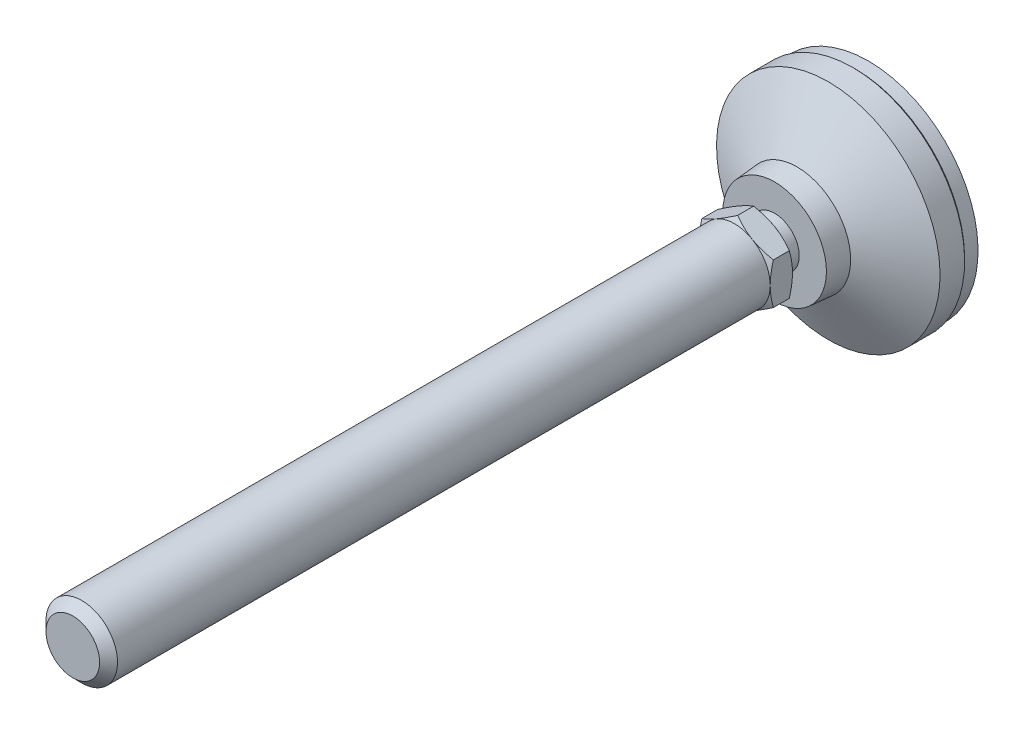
ISO-10303-21;
HEADER;
FILE_DESCRIPTION(('STEP AP214'),'2;1');
FILE_NAME('part.step','',(''),(''),'','','');
FILE_SCHEMA(('AUTOMOTIVE_DESIGN { 1 0 10303 214 1 1 1 1 }'));
ENDSEC;
DATA;
#1=APPLICATION_CONTEXT('core data for automotive mechanical design processes');
#2=APPLICATION_PROTOCOL_DEFINITION('international standard','automotive_design',2000,#1);
#3=PRODUCT_CONTEXT('',#1,'mechanical');
#4=PRODUCT('Part','Part','',(#3));
#5=PRODUCT_RELATED_PRODUCT_CATEGORY('part','',(#4));
#6=PRODUCT_DEFINITION_FORMATION('','',#4);
#7=PRODUCT_DEFINITION_CONTEXT('part definition',#1,'design');
#8=PRODUCT_DEFINITION('design','',#6,#7);
#9=PRODUCT_DEFINITION_SHAPE('','',#8);
#10=(LENGTH_UNIT() NAMED_UNIT(*) SI_UNIT(.MILLI.,.METRE.));
#11=(NAMED_UNIT(*) PLANE_ANGLE_UNIT() SI_UNIT($,.RADIAN.));
#12=(NAMED_UNIT(*) SI_UNIT($,.STERADIAN.) SOLID_ANGLE_UNIT());
#13=UNCERTAINTY_MEASURE_WITH_UNIT(LENGTH_MEASURE(1.E-05),#10,'distance_accuracy_value','');
#14=(GEOMETRIC_REPRESENTATION_CONTEXT(3) GLOBAL_UNCERTAINTY_ASSIGNED_CONTEXT((#13)) GLOBAL_UNIT_ASSIGNED_CONTEXT((#10,
#11,#12)) REPRESENTATION_CONTEXT('',''));
#15=CARTESIAN_POINT('',(0.,0.,0.));
#16=DIRECTION('',(0.,0.,1.));
#17=DIRECTION('',(1.,0.,0.));
#18=AXIS2_PLACEMENT_3D('',#15,#16,#17);
#19=CARTESIAN_POINT('',(0.,-5.50000000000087,24.9999999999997));
#20=DIRECTION('',(0.,0.,-1.));
#21=DIRECTION('',(0.,1.,0.));
#22=AXIS2_PLACEMENT_3D('',#19,#20,#21);
#23=PLANE('',#22);
#24=CARTESIAN_POINT('',(0.,0.,24.9999999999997));
#25=DIRECTION('',(0.,0.,-1.));
#26=DIRECTION('',(0.,1.,0.));
#27=AXIS2_PLACEMENT_3D('',#24,#25,#26);
#28=CIRCLE('',#27,8.0000000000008);
#29=CARTESIAN_POINT('',(-4.00000000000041,6.92820323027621,24.9999999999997));
#30=VERTEX_POINT('',#29);
#31=CARTESIAN_POINT('',(-8.00000000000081,0.,24.9999999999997));
#32=VERTEX_POINT('',#31);
#33=EDGE_CURVE('E9',#30,#32,#28,.F.);
#34=ORIENTED_EDGE('',*,*,#33,.F.);
#35=CARTESIAN_POINT('',(4.,6.92820323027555,24.9999999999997));
#36=VERTEX_POINT('',#35);
#37=EDGE_CURVE('E18',#36,#30,#28,.F.);
#38=ORIENTED_EDGE('',*,*,#37,.F.);
#39=CARTESIAN_POINT('',(8.00000000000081,0.,24.9999999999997));
#40=VERTEX_POINT('',#39);
#41=EDGE_CURVE('E125',#40,#36,#28,.F.);
#42=ORIENTED_EDGE('',*,*,#41,.F.);
#43=CARTESIAN_POINT('',(0.,0.,24.9999999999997));
#44=DIRECTION('',(0.,0.,1.));
#45=DIRECTION('',(0.,-1.,0.));
#46=AXIS2_PLACEMENT_3D('',#43,#44,#45);
#47=CIRCLE('',#46,8.00000000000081);
#48=CARTESIAN_POINT('',(4.00000000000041,-6.92820323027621,24.9999999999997));
#49=VERTEX_POINT('',#48);
#50=EDGE_CURVE('E608',#49,#40,#47,.T.);
#51=ORIENTED_EDGE('',*,*,#50,.F.);
#52=CARTESIAN_POINT('',(-4.00000000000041,-6.92820323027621,24.9999999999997));
#53=VERTEX_POINT('',#52);
#54=EDGE_CURVE('E610',#53,#49,#28,.F.);
#55=ORIENTED_EDGE('',*,*,#54,.F.);
#56=EDGE_CURVE('E23',#32,#53,#28,.F.);
#57=ORIENTED_EDGE('',*,*,#56,.F.);
#58=EDGE_LOOP('',(#34,#38,#42,#51,#55,#57));
#59=FACE_BOUND('',#58,.T.);
#60=CARTESIAN_POINT('',(0.,0.,24.9999999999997));
#61=DIRECTION('',(0.,0.,-1.));
#62=DIRECTION('',(0.,1.,0.));
#63=AXIS2_PLACEMENT_3D('',#60,#61,#62);
#64=CIRCLE('',#63,5.50000000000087);
#65=CARTESIAN_POINT('',(0.,5.50000000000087,24.9999999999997));
#66=VERTEX_POINT('',#65);
#67=EDGE_CURVE('E235',#66,#66,#64,.T.);
#68=ORIENTED_EDGE('',*,*,#67,.F.);
#69=EDGE_LOOP('',(#68));
#70=FACE_BOUND('',#69,.T.);
#71=ADVANCED_FACE('F14',(#59,#70),#23,.T.);
#72=CARTESIAN_POINT('',(0.,0.,2.));
#73=DIRECTION('',(0.,0.,-1.));
#74=DIRECTION('',(0.,1.,0.));
#75=AXIS2_PLACEMENT_3D('',#72,#73,#74);
#76=CYLINDRICAL_SURFACE('',#75,5.50000000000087);
#77=CARTESIAN_POINT('',(0.,0.,21.));
#78=DIRECTION('',(0.,0.,-1.));
#79=DIRECTION('',(0.,1.,0.));
#80=AXIS2_PLACEMENT_3D('',#77,#78,#79);
#81=CIRCLE('',#80,5.50000000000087);
#82=CARTESIAN_POINT('',(0.,5.50000000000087,21.));
#83=VERTEX_POINT('',#82);
#84=EDGE_CURVE('E238',#83,#83,#81,.T.);
#85=ORIENTED_EDGE('',*,*,#84,.F.);
#86=EDGE_LOOP('',(#85));
#87=FACE_BOUND('',#86,.T.);
#88=ORIENTED_EDGE('',*,*,#67,.T.);
#89=EDGE_LOOP('',(#88));
#90=FACE_BOUND('',#89,.T.);
#91=ADVANCED_FACE('F297',(#87,#90),#76,.T.);
#92=CARTESIAN_POINT('',(0.,-5.50000000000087,21.));
#93=DIRECTION('',(0.,0.,1.));
#94=DIRECTION('',(0.,-1.,0.));
#95=AXIS2_PLACEMENT_3D('',#92,#93,#94);
#96=PLANE('',#95);
#97=ORIENTED_EDGE('',*,*,#84,.T.);
#98=EDGE_LOOP('',(#97));
#99=FACE_BOUND('',#98,.T.);
#100=CARTESIAN_POINT('',(0.,0.,21.));
#101=DIRECTION('',(0.,0.,1.));
#102=DIRECTION('',(0.,-1.,0.));
#103=AXIS2_PLACEMENT_3D('',#100,#101,#102);
#104=CIRCLE('',#103,11.5833333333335);
#105=CARTESIAN_POINT('',(0.,-11.5833333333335,21.));
#106=VERTEX_POINT('',#105);
#107=EDGE_CURVE('E241',#106,#106,#104,.T.);
#108=ORIENTED_EDGE('',*,*,#107,.T.);
#109=EDGE_LOOP('',(#108));
#110=FACE_BOUND('',#109,.T.);
#111=ADVANCED_FACE('F199',(#99,#110),#96,.T.);
#112=CARTESIAN_POINT('',(0.,0.,2.));
#113=DIRECTION('',(0.,0.,-1.));
#114=DIRECTION('',(0.,1.,0.));
#115=AXIS2_PLACEMENT_3D('',#112,#113,#114);
#116=CYLINDRICAL_SURFACE('',#115,25.);
#117=CARTESIAN_POINT('',(0.,0.,3.5));
#118=DIRECTION('',(0.,0.,-1.));
#119=DIRECTION('',(0.,1.,0.));
#120=AXIS2_PLACEMENT_3D('',#117,#118,#119);
#121=CIRCLE('',#120,25.);
#122=CARTESIAN_POINT('',(0.,25.,3.5));
#123=VERTEX_POINT('',#122);
#124=EDGE_CURVE('E126',#123,#123,#121,.F.);
#125=ORIENTED_EDGE('',*,*,#124,.T.);
#126=EDGE_LOOP('',(#125));
#127=FACE_BOUND('',#126,.T.);
#128=CARTESIAN_POINT('',(0.,0.,8.9999999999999));
#129=DIRECTION('',(0.,0.,-1.));
#130=DIRECTION('',(0.,1.,0.));
#131=AXIS2_PLACEMENT_3D('',#128,#129,#130);
#132=CIRCLE('',#131,25.);
#133=CARTESIAN_POINT('',(0.,25.,8.9999999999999));
#134=VERTEX_POINT('',#133);
#135=EDGE_CURVE('E244',#134,#134,#132,.T.);
#136=ORIENTED_EDGE('',*,*,#135,.T.);
#137=EDGE_LOOP('',(#136));
#138=FACE_BOUND('',#137,.T.);
#139=ADVANCED_FACE('F275',(#127,#138),#116,.T.);
#140=CARTESIAN_POINT('',(0.,0.,16.));
#141=DIRECTION('',(0.,0.,-1.));
#142=DIRECTION('',(0.,1.,0.));
#143=AXIS2_PLACEMENT_3D('',#140,#141,#142);
#144=CONICAL_SURFACE('',#143,12.0000000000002,1.07685495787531);
#145=ORIENTED_EDGE('',*,*,#135,.F.);
#146=EDGE_LOOP('',(#145));
#147=FACE_BOUND('',#146,.T.);
#148=CARTESIAN_POINT('',(0.,0.,16.));
#149=DIRECTION('',(0.,0.,-1.));
#150=DIRECTION('',(0.,1.,0.));
#151=AXIS2_PLACEMENT_3D('',#148,#149,#150);
#152=CIRCLE('',#151,12.0000000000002);
#153=CARTESIAN_POINT('',(0.,12.0000000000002,16.));
#154=VERTEX_POINT('',#153);
#155=EDGE_CURVE('E260',#154,#154,#152,.T.);
#156=ORIENTED_EDGE('',*,*,#155,.T.);
#157=EDGE_LOOP('',(#156));
#158=FACE_BOUND('',#157,.T.);
#159=ADVANCED_FACE('F332',(#147,#158),#144,.T.);
#160=CARTESIAN_POINT('',(0.,0.,22.));
#161=DIRECTION('',(0.,0.,-1.));
#162=DIRECTION('',(0.,1.,0.));
#163=AXIS2_PLACEMENT_3D('',#160,#161,#162);
#164=CONICAL_SURFACE('',#163,11.5000000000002,0.0831412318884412);
#165=ORIENTED_EDGE('',*,*,#155,.F.);
#166=EDGE_LOOP('',(#165));
#167=FACE_BOUND('',#166,.T.);
#168=ORIENTED_EDGE('',*,*,#107,.F.);
#169=EDGE_LOOP('',(#168));
#170=FACE_BOUND('',#169,.T.);
#171=ADVANCED_FACE('F281',(#167,#170),#164,.T.);
#172=CARTESIAN_POINT('',(0.,0.,3.));
#173=DIRECTION('',(0.,0.,1.));
#174=DIRECTION('',(0.,-1.,0.));
#175=AXIS2_PLACEMENT_3D('',#172,#173,#174);
#176=CONICAL_SURFACE('',#175,24.5,0.785398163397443);
#177=ORIENTED_EDGE('',*,*,#124,.F.);
#178=EDGE_LOOP('',(#177));
#179=FACE_BOUND('',#178,.T.);
#180=CARTESIAN_POINT('',(0.,0.,3.));
#181=DIRECTION('',(0.,0.,-1.));
#182=DIRECTION('',(0.,1.,0.));
#183=AXIS2_PLACEMENT_3D('',#180,#181,#182);
#184=CIRCLE('',#183,24.5);
#185=CARTESIAN_POINT('',(0.,24.5,3.));
#186=VERTEX_POINT('',#185);
#187=EDGE_CURVE('E270',#186,#186,#184,.T.);
#188=ORIENTED_EDGE('',*,*,#187,.F.);
#189=EDGE_LOOP('',(#188));
#190=FACE_BOUND('',#189,.T.);
#191=ADVANCED_FACE('F16',(#179,#190),#176,.T.);
#192=CARTESIAN_POINT('',(0.,0.,0.));
#193=DIRECTION('',(0.,0.,1.));
#194=DIRECTION('',(0.,-1.,0.));
#195=AXIS2_PLACEMENT_3D('',#192,#193,#194);
#196=CYLINDRICAL_SURFACE('',#195,24.5);
#197=CARTESIAN_POINT('',(0.,0.,0.));
#198=DIRECTION('',(0.,0.,-1.));
#199=DIRECTION('',(0.,1.,0.));
#200=AXIS2_PLACEMENT_3D('',#197,#198,#199);
#201=CIRCLE('',#200,24.5);
#202=CARTESIAN_POINT('',(0.,24.5,0.));
#203=VERTEX_POINT('',#202);
#204=EDGE_CURVE('E226',#203,#203,#201,.T.);
#205=ORIENTED_EDGE('',*,*,#204,.F.);
#206=EDGE_LOOP('',(#205));
#207=FACE_BOUND('',#206,.T.);
#208=ORIENTED_EDGE('',*,*,#187,.T.);
#209=EDGE_LOOP('',(#208));
#210=FACE_BOUND('',#209,.T.);
#211=ADVANCED_FACE('F280',(#207,#210),#196,.T.);
#212=CARTESIAN_POINT('',(0.,0.,0.));
#213=DIRECTION('',(0.,0.,-1.));
#214=DIRECTION('',(0.,1.,0.));
#215=AXIS2_PLACEMENT_3D('',#212,#213,#214);
#216=PLANE('',#215);
#217=ORIENTED_EDGE('',*,*,#204,.T.);
#218=EDGE_LOOP('',(#217));
#219=FACE_BOUND('',#218,.T.);
#220=ADVANCED_FACE('F285',(#219),#216,.T.);
#221=CARTESIAN_POINT('',(0.,0.,24.9999999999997));
#222=DIRECTION('',(0.,0.,1.));
#223=DIRECTION('',(0.,-1.,0.));
#224=AXIS2_PLACEMENT_3D('',#221,#222,#223);
#225=CONICAL_SURFACE('',#224,8.00000000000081,1.0471975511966);
#226=CARTESIAN_POINT('',(-8.0002,4.61868668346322,25.7145978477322));
#227=CARTESIAN_POINT('',(-7.8243512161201,4.72021302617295,25.6559907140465));
#228=CARTESIAN_POINT('',(-7.64784680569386,4.8221178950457,25.6000434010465));
#229=CARTESIAN_POINT('',(-7.29340453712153,5.02675523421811,25.4942010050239));
#230=CARTESIAN_POINT('',(-7.11546609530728,5.12948804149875,25.4443085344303));
#231=CARTESIAN_POINT('',(-6.57880176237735,5.43933133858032,25.3046927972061));
#232=CARTESIAN_POINT('',(-6.21795741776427,5.64766491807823,25.2252811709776));
#233=CARTESIAN_POINT('',(-5.67796082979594,5.95943209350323,25.1321616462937));
#234=CARTESIAN_POINT('',(-5.50042181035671,6.06193429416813,25.1056345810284));
#235=CARTESIAN_POINT('',(-5.1445408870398,6.2674022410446,25.0611531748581));
#236=CARTESIAN_POINT('',(-4.96619905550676,6.37036794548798,25.0431980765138));
#237=CARTESIAN_POINT('',(-4.6092083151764,6.57647664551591,25.0163156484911));
#238=CARTESIAN_POINT('',(-4.43055998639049,6.67961930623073,25.0073780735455));
#239=CARTESIAN_POINT('',(-4.07309829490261,6.88599991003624,24.9987223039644));
#240=CARTESIAN_POINT('',(-3.89428493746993,6.9892378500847,24.9990038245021));
#241=CARTESIAN_POINT('',(-3.55998663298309,7.18224506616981,25.0081450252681));
#242=CARTESIAN_POINT('',(-3.40447809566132,7.27202796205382,25.0158896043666));
#243=CARTESIAN_POINT('',(-3.09382523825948,7.4513834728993,25.0382011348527));
#244=CARTESIAN_POINT('',(-2.93868094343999,7.54095607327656,25.0527685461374));
#245=CARTESIAN_POINT('',(-2.47384868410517,7.80932710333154,25.1063606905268));
#246=CARTESIAN_POINT('',(-2.16498351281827,7.98765049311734,25.1552686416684));
#247=CARTESIAN_POINT('',(-1.54397677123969,8.3461889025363,25.2775394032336));
#248=CARTESIAN_POINT('',(-1.23191445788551,8.52635816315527,25.3514205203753));
#249=CARTESIAN_POINT('',(-0.61244351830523,8.8840098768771,25.5191001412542));
#250=CARTESIAN_POINT('',(-0.305026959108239,9.06149691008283,25.6128592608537));
#251=CARTESIAN_POINT('',(0.000200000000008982,9.23771977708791,25.7145978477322));
#252=B_SPLINE_CURVE_WITH_KNOTS('',3,(#226,#227,#228,#229,#230,#231,#232,#233,#234,#235,#236,
#237,#238,#239,#240,#241,#242,#243,#244,#245,#246,#247,#248,#249,#250,#251),.UNSPECIFIED.,.F.,
.F.,(4,2,2,2,2,2,2,2,2,2,2,2,4),(0.,0.633973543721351,1.26821965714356,2.53934712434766,
3.15934343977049,3.77928496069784,4.39852133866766,5.01773858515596,5.55680239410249,
6.09590254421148,7.17487077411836,8.27776850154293,9.37850115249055),.UNSPECIFIED.);
#253=CARTESIAN_POINT('',(0.,9.23760430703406,25.7145311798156));
#254=VERTEX_POINT('',#253);
#255=EDGE_CURVE('E115',#30,#254,#252,.T.);
#256=ORIENTED_EDGE('',*,*,#255,.T.);
#257=CARTESIAN_POINT('',(-0.000199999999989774,9.2377197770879,25.7145978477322));
#258=CARTESIAN_POINT('',(0.175648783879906,9.13619343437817,25.6559907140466));
#259=CARTESIAN_POINT('',(0.352153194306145,9.03428856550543,25.6000434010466));
#260=CARTESIAN_POINT('',(0.706595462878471,8.82965122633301,25.4942010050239));
#261=CARTESIAN_POINT('',(0.884533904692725,8.72691841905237,25.4443085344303));
#262=CARTESIAN_POINT('',(1.42119823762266,8.4170751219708,25.3046927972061));
#263=CARTESIAN_POINT('',(1.78204258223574,8.20874154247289,25.2252811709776));
#264=CARTESIAN_POINT('',(2.32203917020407,7.89697436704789,25.1321616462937));
#265=CARTESIAN_POINT('',(2.4995781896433,7.79447216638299,25.1056345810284));
#266=CARTESIAN_POINT('',(2.85545911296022,7.58900421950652,25.0611531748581));
#267=CARTESIAN_POINT('',(3.03380094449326,7.48603851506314,25.0431980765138));
#268=CARTESIAN_POINT('',(3.39079168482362,7.27992981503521,25.0163156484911));
#269=CARTESIAN_POINT('',(3.56944001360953,7.17678715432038,25.0073780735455));
#270=CARTESIAN_POINT('',(3.92690170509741,6.97040655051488,24.9987223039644));
#271=CARTESIAN_POINT('',(4.1057150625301,6.86716861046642,24.9990038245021));
#272=CARTESIAN_POINT('',(4.44001336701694,6.67416139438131,25.0081450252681));
#273=CARTESIAN_POINT('',(4.5955219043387,6.5843784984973,25.0158896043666));
#274=CARTESIAN_POINT('',(4.90617476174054,6.40502298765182,25.0382011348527));
#275=CARTESIAN_POINT('',(5.06131905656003,6.31545038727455,25.0527685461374));
#276=CARTESIAN_POINT('',(5.52615131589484,6.04707935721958,25.1063606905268));
#277=CARTESIAN_POINT('',(5.83501648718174,5.86875596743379,25.1552686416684));
#278=CARTESIAN_POINT('',(6.45602322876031,5.51021755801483,25.2775394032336));
#279=CARTESIAN_POINT('',(6.76808554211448,5.33004829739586,25.3514205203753));
#280=CARTESIAN_POINT('',(7.38755648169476,4.97239658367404,25.5191001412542));
#281=CARTESIAN_POINT('',(7.69497304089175,4.79490955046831,25.6128592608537));
#282=CARTESIAN_POINT('',(8.0002,4.61868668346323,25.7145978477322));
#283=B_SPLINE_CURVE_WITH_KNOTS('',3,(#257,#258,#259,#260,#261,#262,#263,#264,#265,#266,#267,
#268,#269,#270,#271,#272,#273,#274,#275,#276,#277,#278,#279,#280,#281,#282),.UNSPECIFIED.,.F.,
.F.,(4,2,2,2,2,2,2,2,2,2,2,2,4),(0.,0.633973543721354,1.26821965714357,2.53934712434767,
3.1593434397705,3.77928496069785,4.39852133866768,5.01773858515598,5.55680239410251,
6.0959025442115,7.17487077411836,8.27776850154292,9.37850115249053),.UNSPECIFIED.);
#284=EDGE_CURVE('E121',#254,#36,#283,.T.);
#285=ORIENTED_EDGE('',*,*,#284,.T.);
#286=ORIENTED_EDGE('',*,*,#37,.T.);
#287=EDGE_LOOP('',(#256,#285,#286));
#288=FACE_BOUND('',#287,.T.);
#289=ADVANCED_FACE('F119',(#288),#225,.T.);
#290=CARTESIAN_POINT('',(8.,12.3458574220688,28.8747286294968));
#291=CARTESIAN_POINT('',(8.,11.9969551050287,28.7057251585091));
#292=CARTESIAN_POINT('',(8.,11.6472453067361,28.5383598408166));
#293=CARTESIAN_POINT('',(8.,10.9457810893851,28.2078280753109));
#294=CARTESIAN_POINT('',(8.,10.594026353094,28.0446623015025));
#295=CARTESIAN_POINT('',(8.,9.88620084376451,27.7226182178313));
#296=CARTESIAN_POINT('',(8.,9.53011695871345,27.5637686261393));
#297=CARTESIAN_POINT('',(8.,8.81509575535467,27.2526517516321));
#298=CARTESIAN_POINT('',(8.,8.45615857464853,27.1003841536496));
#299=CARTESIAN_POINT('',(8.,7.72350058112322,26.7995062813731));
#300=CARTESIAN_POINT('',(8.,7.34966997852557,26.6511618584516));
#301=CARTESIAN_POINT('',(8.,6.59761367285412,26.3658482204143));
#302=CARTESIAN_POINT('',(8.,6.21938747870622,26.2288802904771));
#303=CARTESIAN_POINT('',(8.,5.45866154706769,25.9699604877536));
#304=CARTESIAN_POINT('',(8.,5.07617245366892,25.8479776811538));
#305=CARTESIAN_POINT('',(8.,4.30572212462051,25.6229807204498));
#306=CARTESIAN_POINT('',(8.,3.91776267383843,25.5199605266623));
#307=CARTESIAN_POINT('',(8.,3.13823354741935,25.3384257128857));
#308=CARTESIAN_POINT('',(8.,2.74669521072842,25.259780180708));
#309=CARTESIAN_POINT('',(8.,2.15587134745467,25.1635266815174));
#310=CARTESIAN_POINT('',(8.,1.958328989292,25.1350599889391));
#311=CARTESIAN_POINT('',(8.,1.56228321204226,25.0859245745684));
#312=CARTESIAN_POINT('',(8.,1.36377988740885,25.0652551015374));
#313=CARTESIAN_POINT('',(8.,0.968644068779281,25.0323819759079));
#314=CARTESIAN_POINT('',(8.,0.772020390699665,25.020072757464));
#315=CARTESIAN_POINT('',(8.,0.378428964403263,25.0037759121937));
#316=CARTESIAN_POINT('',(8.,0.181461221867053,24.999788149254));
#317=CARTESIAN_POINT('',(8.,-0.212466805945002,25.0002291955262));
#318=CARTESIAN_POINT('',(8.,-0.409427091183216,25.004658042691));
#319=CARTESIAN_POINT('',(8.,-0.802987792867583,25.0218251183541));
#320=CARTESIAN_POINT('',(8.,-0.999588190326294,25.0345637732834));
#321=CARTESIAN_POINT('',(8.,-1.47395001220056,25.0750576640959));
#322=CARTESIAN_POINT('',(8.,-1.75137309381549,25.1068594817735));
#323=CARTESIAN_POINT('',(8.,-2.3041068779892,25.1852601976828));
#324=CARTESIAN_POINT('',(8.,-2.57941728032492,25.2318611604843));
#325=CARTESIAN_POINT('',(8.,-3.40189552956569,25.3913871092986));
#326=CARTESIAN_POINT('',(8.,-3.9452914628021,25.5240043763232));
#327=CARTESIAN_POINT('',(8.,-4.7577099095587,25.7532963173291));
#328=CARTESIAN_POINT('',(8.,-5.03096372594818,25.8358353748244));
#329=CARTESIAN_POINT('',(8.,-5.57481633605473,26.0093182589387));
#330=CARTESIAN_POINT('',(8.,-5.8454151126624,26.10026213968));
#331=CARTESIAN_POINT('',(8.,-6.38404580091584,26.2891095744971));
#332=CARTESIAN_POINT('',(8.,-6.65207856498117,26.3870107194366));
#333=CARTESIAN_POINT('',(8.,-7.18593501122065,26.5886376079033));
#334=CARTESIAN_POINT('',(8.,-7.45175871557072,26.6923632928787));
#335=CARTESIAN_POINT('',(8.,-8.06340190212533,26.9375197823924));
#336=CARTESIAN_POINT('',(8.,-8.40852408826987,27.0806867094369));
#337=CARTESIAN_POINT('',(8.,-9.09595609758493,27.3736388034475));
#338=CARTESIAN_POINT('',(8.,-9.43826576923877,27.523424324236));
#339=CARTESIAN_POINT('',(8.,-10.1205692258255,27.8283285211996));
#340=CARTESIAN_POINT('',(8.,-10.4605625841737,27.9834481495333));
#341=CARTESIAN_POINT('',(8.,-11.1385570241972,28.29798926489));
#342=CARTESIAN_POINT('',(8.,-11.4765580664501,28.4574108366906));
#343=CARTESIAN_POINT('',(8.,-12.1512077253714,28.7799286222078));
#344=CARTESIAN_POINT('',(8.,-12.4878546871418,28.9430282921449));
#345=CARTESIAN_POINT('',(8.,-13.1597216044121,29.2721433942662));
#346=CARTESIAN_POINT('',(8.,-13.4949415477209,29.4381588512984));
#347=CARTESIAN_POINT('',(8.,-14.4987114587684,29.9397861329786));
#348=CARTESIAN_POINT('',(8.,-15.1654523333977,30.2790178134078));
#349=CARTESIAN_POINT('',(8.,-16.4421751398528,30.9369143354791));
#350=CARTESIAN_POINT('',(8.,-17.0524295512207,31.2550527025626));
#351=CARTESIAN_POINT('',(8.,-18.270646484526,31.8957306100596));
#352=CARTESIAN_POINT('',(8.,-18.8786089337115,32.2182702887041));
#353=CARTESIAN_POINT('',(8.,-20.091327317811,32.8659669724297));
#354=CARTESIAN_POINT('',(8.,-20.6960874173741,33.1911161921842));
#355=CARTESIAN_POINT('',(8.,-21.9041323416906,33.8440710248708));
#356=CARTESIAN_POINT('',(8.,-22.5074172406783,34.1718765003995));
#357=CARTESIAN_POINT('',(8.,-23.1101545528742,34.5006789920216));
#358=B_SPLINE_CURVE_WITH_KNOTS('',3,(#290,#291,#292,#293,#294,#295,#296,#297,#298,#299,#300,
#301,#302,#303,#304,#305,#306,#307,#308,#309,#310,#311,#312,#313,#314,#315,#316,#317,#318,#319,
#320,#321,#322,#323,#324,#325,#326,#327,#328,#329,#330,#331,#332,#333,#334,#335,#336,#337,#338,
#339,#340,#341,#342,#343,#344,#345,#346,#347,#348,#349,#350,#351,#352,#353,#354,#355,#356,#357),
.UNSPECIFIED.,.F.,.F.,(4,2,2,2,2,2,2,2,2,2,2,2,2,2,2,2,2,2,2,2,2,2,2,2,2,2,2,2,2,2,2,2,2,4),(0.,
1.16305147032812,2.3262884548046,3.49596171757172,4.66557891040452,5.87200002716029,
7.07855724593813,8.28258035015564,9.48621930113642,10.6832769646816,11.2818959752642,
11.8804572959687,12.4713125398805,13.0621581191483,13.653006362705,14.2438849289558,
15.0811302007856,15.9184923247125,17.5941735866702,18.4504472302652,19.3067263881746,
20.1627104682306,21.0186859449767,22.1395116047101,23.2603972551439,24.3814840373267,
25.5025929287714,26.6248032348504,27.7470231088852,29.9911937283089,32.0557815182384,
34.1204343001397,36.1803085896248,38.2400769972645),.UNSPECIFIED.);
#359=CARTESIAN_POINT('',(8.,4.61880215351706,25.7145311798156));
#360=VERTEX_POINT('',#359);
#361=EDGE_CURVE('E134',#360,#40,#358,.T.);
#362=ORIENTED_EDGE('',*,*,#361,.T.);
#363=ORIENTED_EDGE('',*,*,#41,.T.);
#364=EDGE_CURVE('E171',#36,#360,#283,.T.);
#365=ORIENTED_EDGE('',*,*,#364,.T.);
#366=EDGE_LOOP('',(#362,#363,#365));
#367=FACE_BOUND('',#366,.T.);
#368=ADVANCED_FACE('F159',(#367),#225,.T.);
#369=CARTESIAN_POINT('',(8.0002,-4.61868668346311,25.7145978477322));
#370=CARTESIAN_POINT('',(7.82435121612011,-4.72021302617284,25.6559907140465));
#371=CARTESIAN_POINT('',(7.64784680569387,-4.82211789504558,25.6000434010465));
#372=CARTESIAN_POINT('',(7.29340453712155,-5.02675523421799,25.4942010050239));
#373=CARTESIAN_POINT('',(7.1154660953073,-5.12948804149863,25.4443085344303));
#374=CARTESIAN_POINT('',(6.57880176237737,-5.4393313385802,25.3046927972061));
#375=CARTESIAN_POINT('',(6.21795741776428,-5.64766491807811,25.2252811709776));
#376=CARTESIAN_POINT('',(5.67796082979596,-5.95943209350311,25.1321616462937));
#377=CARTESIAN_POINT('',(5.50042181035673,-6.06193429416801,25.1056345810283));
#378=CARTESIAN_POINT('',(5.14454088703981,-6.26740224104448,25.0611531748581));
#379=CARTESIAN_POINT('',(4.96619905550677,-6.37036794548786,25.0431980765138));
#380=CARTESIAN_POINT('',(4.60920831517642,-6.57647664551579,25.0163156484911));
#381=CARTESIAN_POINT('',(4.43055998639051,-6.67961930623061,25.0073780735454));
#382=CARTESIAN_POINT('',(4.07309829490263,-6.88599991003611,24.9987223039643));
#383=CARTESIAN_POINT('',(3.89428493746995,-6.98923785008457,24.999003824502));
#384=CARTESIAN_POINT('',(3.55998663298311,-7.18224506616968,25.008145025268));
#385=CARTESIAN_POINT('',(3.40447809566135,-7.27202796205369,25.0158896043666));
#386=CARTESIAN_POINT('',(3.09382523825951,-7.45138347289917,25.0382011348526));
#387=CARTESIAN_POINT('',(2.93868094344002,-7.54095607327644,25.0527685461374));
#388=CARTESIAN_POINT('',(2.4738486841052,-7.80932710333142,25.1063606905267));
#389=CARTESIAN_POINT('',(2.1649835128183,-7.98765049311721,25.1552686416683));
#390=CARTESIAN_POINT('',(1.54397677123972,-8.34618890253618,25.2775394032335));
#391=CARTESIAN_POINT('',(1.23191445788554,-8.52635816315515,25.3514205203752));
#392=CARTESIAN_POINT('',(0.612443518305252,-8.88400987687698,25.5191001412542));
#393=CARTESIAN_POINT('',(0.305026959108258,-9.06149691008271,25.6128592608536));
#394=CARTESIAN_POINT('',(-0.000199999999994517,-9.23771977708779,25.7145978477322));
#395=B_SPLINE_CURVE_WITH_KNOTS('',3,(#369,#370,#371,#372,#373,#374,#375,#376,#377,#378,#379,
#380,#381,#382,#383,#384,#385,#386,#387,#388,#389,#390,#391,#392,#393,#394),.UNSPECIFIED.,.F.,
.F.,(4,2,2,2,2,2,2,2,2,2,2,2,4),(0.,0.633973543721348,1.26821965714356,2.53934712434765,
3.15934343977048,3.77928496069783,4.39852133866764,5.01773858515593,5.55680239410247,
6.09590254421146,7.17487077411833,8.27776850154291,9.37850115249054),.UNSPECIFIED.);
#396=CARTESIAN_POINT('',(8.,-4.61880215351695,25.7145311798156));
#397=VERTEX_POINT('',#396);
#398=EDGE_CURVE('E149',#397,#49,#395,.T.);
#399=ORIENTED_EDGE('',*,*,#398,.T.);
#400=ORIENTED_EDGE('',*,*,#50,.T.);
#401=EDGE_CURVE('E114',#40,#397,#358,.T.);
#402=ORIENTED_EDGE('',*,*,#401,.T.);
#403=EDGE_LOOP('',(#399,#400,#402));
#404=FACE_BOUND('',#403,.T.);
#405=ADVANCED_FACE('F163',(#404),#225,.T.);
#406=CARTESIAN_POINT('',(0.000200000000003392,-9.23771977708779,25.7145978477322));
#407=CARTESIAN_POINT('',(-0.175648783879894,-9.13619343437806,25.6559907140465));
#408=CARTESIAN_POINT('',(-0.352153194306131,-9.03428856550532,25.6000434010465));
#409=CARTESIAN_POINT('',(-0.706595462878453,-8.8296512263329,25.4942010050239));
#410=CARTESIAN_POINT('',(-0.884533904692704,-8.72691841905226,25.4443085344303));
#411=CARTESIAN_POINT('',(-1.42119823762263,-8.4170751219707,25.3046927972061));
#412=CARTESIAN_POINT('',(-1.78204258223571,-8.20874154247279,25.2252811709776));
#413=CARTESIAN_POINT('',(-2.32203917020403,-7.8969743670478,25.1321616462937));
#414=CARTESIAN_POINT('',(-2.49957818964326,-7.79447216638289,25.1056345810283));
#415=CARTESIAN_POINT('',(-2.85545911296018,-7.58900421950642,25.0611531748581));
#416=CARTESIAN_POINT('',(-3.03380094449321,-7.48603851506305,25.0431980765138));
#417=CARTESIAN_POINT('',(-3.39079168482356,-7.27992981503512,25.0163156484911));
#418=CARTESIAN_POINT('',(-3.56944001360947,-7.1767871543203,25.0073780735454));
#419=CARTESIAN_POINT('',(-3.92690170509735,-6.9704065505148,24.9987223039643));
#420=CARTESIAN_POINT('',(-4.10571506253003,-6.86716861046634,24.999003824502));
#421=CARTESIAN_POINT('',(-4.44001336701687,-6.67416139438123,25.008145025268));
#422=CARTESIAN_POINT('',(-4.59552190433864,-6.58437849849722,25.0158896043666));
#423=CARTESIAN_POINT('',(-4.90617476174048,-6.40502298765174,25.0382011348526));
#424=CARTESIAN_POINT('',(-5.06131905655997,-6.31545038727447,25.0527685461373));
#425=CARTESIAN_POINT('',(-5.52615131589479,-6.04707935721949,25.1063606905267));
#426=CARTESIAN_POINT('',(-5.8350164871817,-5.86875596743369,25.1552686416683));
#427=CARTESIAN_POINT('',(-6.45602322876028,-5.51021755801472,25.2775394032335));
#428=CARTESIAN_POINT('',(-6.76808554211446,-5.33004829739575,25.3514205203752));
#429=CARTESIAN_POINT('',(-7.38755648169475,-4.97239658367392,25.5191001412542));
#430=CARTESIAN_POINT('',(-7.69497304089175,-4.79490955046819,25.6128592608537));
#431=CARTESIAN_POINT('',(-8.0002,-4.61868668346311,25.7145978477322));
#432=B_SPLINE_CURVE_WITH_KNOTS('',3,(#406,#407,#408,#409,#410,#411,#412,#413,#414,#415,#416,
#417,#418,#419,#420,#421,#422,#423,#424,#425,#426,#427,#428,#429,#430,#431),.UNSPECIFIED.,.F.,
.F.,(4,2,2,2,2,2,2,2,2,2,2,2,4),(0.,0.633973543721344,1.26821965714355,2.53934712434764,
3.15934343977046,3.7792849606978,4.39852133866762,5.01773858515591,5.55680239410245,
6.09590254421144,7.17487077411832,8.27776850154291,9.37850115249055),.UNSPECIFIED.);
#433=CARTESIAN_POINT('',(0.,-9.23760430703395,25.7145311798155));
#434=VERTEX_POINT('',#433);
#435=EDGE_CURVE('E37',#434,#53,#432,.T.);
#436=ORIENTED_EDGE('',*,*,#435,.T.);
#437=ORIENTED_EDGE('',*,*,#54,.T.);
#438=EDGE_CURVE('E552',#49,#434,#395,.T.);
#439=ORIENTED_EDGE('',*,*,#438,.T.);
#440=EDGE_LOOP('',(#436,#437,#439));
#441=FACE_BOUND('',#440,.T.);
#442=ADVANCED_FACE('F165',(#441),#225,.T.);
#443=CARTESIAN_POINT('',(-8.,-4.61880215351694,25.7145311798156));
#444=VERTEX_POINT('',#443);
#445=EDGE_CURVE('E186',#53,#444,#432,.T.);
#446=ORIENTED_EDGE('',*,*,#445,.T.);
#447=CARTESIAN_POINT('',(-8.,12.3458574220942,28.8747286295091));
#448=CARTESIAN_POINT('',(-8.,11.9969551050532,28.7057251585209));
#449=CARTESIAN_POINT('',(-8.00000000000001,11.6472453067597,28.5383598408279));
#450=CARTESIAN_POINT('',(-8.00000000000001,10.945781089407,28.2078280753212));
#451=CARTESIAN_POINT('',(-8.00000000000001,10.5940263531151,28.0446623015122));
#452=CARTESIAN_POINT('',(-8.00000000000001,9.88620084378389,27.72261821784));
#453=CARTESIAN_POINT('',(-8.00000000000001,9.53011695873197,27.5637686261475));
#454=CARTESIAN_POINT('',(-8.00000000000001,8.81509575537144,27.2526517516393));
#455=CARTESIAN_POINT('',(-8.00000000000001,8.45615857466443,27.1003841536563));
#456=CARTESIAN_POINT('',(-8.00000000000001,7.72350058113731,26.7995062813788));
#457=CARTESIAN_POINT('',(-8.00000000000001,7.34966997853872,26.6511618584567));
#458=CARTESIAN_POINT('',(-8.00000000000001,6.59761367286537,26.3658482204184));
#459=CARTESIAN_POINT('',(-8.,6.21938747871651,26.2288802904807));
#460=CARTESIAN_POINT('',(-8.,5.45866154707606,25.9699604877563));
#461=CARTESIAN_POINT('',(-8.00000000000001,5.07617245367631,25.8479776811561));
#462=CARTESIAN_POINT('',(-8.,4.30572212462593,25.6229807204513));
#463=CARTESIAN_POINT('',(-8.,3.91776267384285,25.5199605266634));
#464=CARTESIAN_POINT('',(-8.,3.13823354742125,25.338425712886));
#465=CARTESIAN_POINT('',(-8.,2.74669521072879,25.259780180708));
#466=CARTESIAN_POINT('',(-8.,2.15587134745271,25.1635266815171));
#467=CARTESIAN_POINT('',(-8.,1.95832898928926,25.1350599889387));
#468=CARTESIAN_POINT('',(-8.,1.56228321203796,25.085924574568));
#469=CARTESIAN_POINT('',(-8.,1.36377988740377,25.0652551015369));
#470=CARTESIAN_POINT('',(-8.,0.96864406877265,25.0323819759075));
#471=CARTESIAN_POINT('',(-8.,0.772020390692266,25.0200727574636));
#472=CARTESIAN_POINT('',(-8.,0.37842896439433,25.0037759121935));
#473=CARTESIAN_POINT('',(-8.,0.181461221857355,24.9997881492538));
#474=CARTESIAN_POINT('',(-8.,-0.212466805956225,25.0002291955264));
#475=CARTESIAN_POINT('',(-8.,-0.409427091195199,25.0046580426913));
#476=CARTESIAN_POINT('',(-8.,-0.802987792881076,25.0218251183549));
#477=CARTESIAN_POINT('',(-8.,-0.999588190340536,25.0345637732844));
#478=CARTESIAN_POINT('',(-8.,-1.47395001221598,25.0750576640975));
#479=CARTESIAN_POINT('',(-8.,-1.75137309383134,25.1068594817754));
#480=CARTESIAN_POINT('',(-8.,-2.30410687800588,25.1852601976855));
#481=CARTESIAN_POINT('',(-8.,-2.57941728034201,25.2318611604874));
#482=CARTESIAN_POINT('',(-8.,-3.40189552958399,25.3913871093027));
#483=CARTESIAN_POINT('',(-8.,-3.94529146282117,25.524004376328));
#484=CARTESIAN_POINT('',(-8.,-4.75770990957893,25.7532963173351));
#485=CARTESIAN_POINT('',(-8.,-5.03096372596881,25.8358353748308));
#486=CARTESIAN_POINT('',(-8.,-5.57481633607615,26.0093182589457));
#487=CARTESIAN_POINT('',(-8.,-5.84541511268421,26.1002621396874));
#488=CARTESIAN_POINT('',(-8.,-6.38404580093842,26.2891095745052));
#489=CARTESIAN_POINT('',(-8.,-6.65207856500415,26.3870107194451));
#490=CARTESIAN_POINT('',(-8.,-7.1859350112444,26.5886376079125));
#491=CARTESIAN_POINT('',(-8.,-7.45175871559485,26.6923632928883));
#492=CARTESIAN_POINT('',(-8.,-8.06340190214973,26.9375197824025));
#493=CARTESIAN_POINT('',(-8.,-8.40852408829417,27.0806867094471));
#494=CARTESIAN_POINT('',(-8.,-9.09595609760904,27.373638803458));
#495=CARTESIAN_POINT('',(-8.,-9.43826576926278,27.5234243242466));
#496=CARTESIAN_POINT('',(-8.,-10.1205692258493,27.8283285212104));
#497=CARTESIAN_POINT('',(-8.,-10.4605625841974,27.9834481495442));
#498=CARTESIAN_POINT('',(-8.,-11.1385570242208,28.297989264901));
#499=CARTESIAN_POINT('',(-8.,-11.4765580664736,28.4574108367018));
#500=CARTESIAN_POINT('',(-8.,-12.1512077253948,28.7799286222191));
#501=CARTESIAN_POINT('',(-8.,-12.4878546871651,28.9430282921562));
#502=CARTESIAN_POINT('',(-8.,-13.1597216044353,29.2721433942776));
#503=CARTESIAN_POINT('',(-8.,-13.494941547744,29.4381588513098));
#504=CARTESIAN_POINT('',(-8.,-14.4987114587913,29.9397861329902));
#505=CARTESIAN_POINT('',(-8.,-15.1654523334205,30.2790178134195));
#506=CARTESIAN_POINT('',(-8.,-16.4421751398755,30.9369143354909));
#507=CARTESIAN_POINT('',(-7.99999999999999,-17.0524295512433,31.2550527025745));
#508=CARTESIAN_POINT('',(-7.99999999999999,-18.2706464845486,31.8957306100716));
#509=CARTESIAN_POINT('',(-7.99999999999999,-18.8786089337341,32.2182702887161));
#510=CARTESIAN_POINT('',(-7.99999999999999,-20.0913273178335,32.8659669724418));
#511=CARTESIAN_POINT('',(-7.99999999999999,-20.6960874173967,33.1911161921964));
#512=CARTESIAN_POINT('',(-7.99999999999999,-21.9041323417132,33.844071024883));
#513=CARTESIAN_POINT('',(-7.99999999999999,-22.5074172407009,34.1718765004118));
#514=CARTESIAN_POINT('',(-8.,-23.1101545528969,34.5006789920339));
#515=B_SPLINE_CURVE_WITH_KNOTS('',3,(#447,#448,#449,#450,#451,#452,#453,#454,#455,#456,#457,
#458,#459,#460,#461,#462,#463,#464,#465,#466,#467,#468,#469,#470,#471,#472,#473,#474,#475,#476,
#477,#478,#479,#480,#481,#482,#483,#484,#485,#486,#487,#488,#489,#490,#491,#492,#493,#494,#495,
#496,#497,#498,#499,#500,#501,#502,#503,#504,#505,#506,#507,#508,#509,#510,#511,#512,#513,#514),
.UNSPECIFIED.,.F.,.F.,(4,2,2,2,2,2,2,2,2,2,2,2,2,2,2,2,2,2,2,2,2,2,2,2,2,2,2,2,2,2,2,2,2,4),(0.,
1.16305147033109,2.32628845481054,3.49596171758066,4.66557891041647,5.87200002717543,
7.07855724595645,8.28258035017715,9.48621930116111,10.683276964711,11.2818959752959,
11.8804572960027,12.4713125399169,13.0621581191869,13.6530063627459,14.243884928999,
15.0811302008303,15.9184923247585,17.594173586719,18.4504472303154,19.3067263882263,
20.1627104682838,21.0186859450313,22.1395116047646,23.2603972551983,24.381484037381,
25.5025929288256,26.6248032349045,27.7470231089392,29.9911937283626,32.0557815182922,
34.1204343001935,36.1803085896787,38.2400769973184),.UNSPECIFIED.);
#516=EDGE_CURVE('E30',#444,#32,#515,.F.);
#517=ORIENTED_EDGE('',*,*,#516,.T.);
#518=ORIENTED_EDGE('',*,*,#56,.T.);
#519=EDGE_LOOP('',(#446,#517,#518));
#520=FACE_BOUND('',#519,.T.);
#521=ADVANCED_FACE('F447',(#520),#225,.T.);
#522=CARTESIAN_POINT('',(-8.,4.61880215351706,25.7145311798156));
#523=VERTEX_POINT('',#522);
#524=EDGE_CURVE('E109',#32,#523,#515,.F.);
#525=ORIENTED_EDGE('',*,*,#524,.T.);
#526=EDGE_CURVE('E103',#523,#30,#252,.T.);
#527=ORIENTED_EDGE('',*,*,#526,.T.);
#528=ORIENTED_EDGE('',*,*,#33,.T.);
#529=EDGE_LOOP('',(#525,#527,#528));
#530=FACE_BOUND('',#529,.T.);
#531=ADVANCED_FACE('F105',(#530),#225,.T.);
#532=CARTESIAN_POINT('',(0.,0.,178.));
#533=DIRECTION('',(0.,0.,-1.));
#534=DIRECTION('',(0.,1.,0.));
#535=AXIS2_PLACEMENT_3D('',#532,#533,#534);
#536=PLANE('',#535);
#537=CARTESIAN_POINT('',(0.,0.,178.));
#538=DIRECTION('',(0.,0.,-1.));
#539=DIRECTION('',(0.,1.,0.));
#540=AXIS2_PLACEMENT_3D('',#537,#538,#539);
#541=CIRCLE('',#540,6.00000000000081);
#542=CARTESIAN_POINT('',(0.,6.00000000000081,178.));
#543=VERTEX_POINT('',#542);
#544=EDGE_CURVE('E232',#543,#543,#541,.T.);
#545=ORIENTED_EDGE('',*,*,#544,.F.);
#546=EDGE_LOOP('',(#545));
#547=FACE_BOUND('',#546,.T.);
#548=ADVANCED_FACE('F305',(#547),#536,.F.);
#549=CARTESIAN_POINT('',(0.,0.,178.));
#550=DIRECTION('',(0.,0.,-1.));
#551=DIRECTION('',(0.,1.,0.));
#552=AXIS2_PLACEMENT_3D('',#549,#550,#551);
#553=CONICAL_SURFACE('',#552,6.00000000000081,0.785398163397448);
#554=CARTESIAN_POINT('',(0.,0.,176.));
#555=DIRECTION('',(0.,0.,-1.));
#556=DIRECTION('',(0.,1.,0.));
#557=AXIS2_PLACEMENT_3D('',#554,#555,#556);
#558=CIRCLE('',#557,8.00000000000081);
#559=CARTESIAN_POINT('',(0.,8.00000000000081,176.));
#560=VERTEX_POINT('',#559);
#561=EDGE_CURVE('E229',#560,#560,#558,.T.);
#562=ORIENTED_EDGE('',*,*,#561,.F.);
#563=EDGE_LOOP('',(#562));
#564=FACE_BOUND('',#563,.T.);
#565=ORIENTED_EDGE('',*,*,#544,.T.);
#566=EDGE_LOOP('',(#565));
#567=FACE_BOUND('',#566,.T.);
#568=ADVANCED_FACE('F307',(#564,#567),#553,.T.);
#569=CARTESIAN_POINT('',(0.,0.,2.));
#570=DIRECTION('',(0.,0.,-1.));
#571=DIRECTION('',(0.,1.,0.));
#572=AXIS2_PLACEMENT_3D('',#569,#570,#571);
#573=CYLINDRICAL_SURFACE('',#572,8.00000000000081);
#574=CARTESIAN_POINT('',(0.,0.,30.));
#575=DIRECTION('',(0.,0.,1.));
#576=DIRECTION('',(0.,-1.,0.));
#577=AXIS2_PLACEMENT_3D('',#574,#575,#576);
#578=CIRCLE('',#577,8.00000000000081);
#579=CARTESIAN_POINT('',(-4.00000000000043,-6.9282032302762,30.));
#580=VERTEX_POINT('',#579);
#581=CARTESIAN_POINT('',(4.00000000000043,-6.9282032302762,30.));
#582=VERTEX_POINT('',#581);
#583=EDGE_CURVE('E263',#580,#582,#578,.T.);
#584=ORIENTED_EDGE('',*,*,#583,.T.);
#585=CARTESIAN_POINT('',(0.,0.,30.));
#586=DIRECTION('',(0.,0.,1.));
#587=DIRECTION('',(0.,-1.,0.));
#588=AXIS2_PLACEMENT_3D('',#585,#586,#587);
#589=CIRCLE('',#588,8.00000000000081);
#590=CARTESIAN_POINT('',(8.00000000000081,0.,30.));
#591=VERTEX_POINT('',#590);
#592=EDGE_CURVE('E548',#582,#591,#589,.T.);
#593=ORIENTED_EDGE('',*,*,#592,.T.);
#594=CARTESIAN_POINT('',(4.,6.92820323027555,30.));
#595=VERTEX_POINT('',#594);
#596=EDGE_CURVE('E267',#591,#595,#578,.T.);
#597=ORIENTED_EDGE('',*,*,#596,.T.);
#598=CARTESIAN_POINT('',(-4.00000000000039,6.92820323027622,30.));
#599=VERTEX_POINT('',#598);
#600=EDGE_CURVE('E596',#595,#599,#578,.T.);
#601=ORIENTED_EDGE('',*,*,#600,.T.);
#602=CARTESIAN_POINT('',(-8.00000000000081,0.,30.));
#603=VERTEX_POINT('',#602);
#604=EDGE_CURVE('E601',#599,#603,#578,.T.);
#605=ORIENTED_EDGE('',*,*,#604,.T.);
#606=EDGE_CURVE('E266',#603,#580,#578,.T.);
#607=ORIENTED_EDGE('',*,*,#606,.T.);
#608=EDGE_LOOP('',(#584,#593,#597,#601,#605,#607));
#609=FACE_BOUND('',#608,.T.);
#610=ORIENTED_EDGE('',*,*,#561,.T.);
#611=EDGE_LOOP('',(#610));
#612=FACE_BOUND('',#611,.T.);
#613=ADVANCED_FACE('F310',(#609,#612),#573,.T.);
#614=CARTESIAN_POINT('',(0.,0.,28.594394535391));
#615=DIRECTION('',(0.,0.,-1.));
#616=DIRECTION('',(0.,1.,0.));
#617=AXIS2_PLACEMENT_3D('',#614,#615,#616);
#618=CONICAL_SURFACE('',#617,10.4345800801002,1.0471975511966);
#619=CARTESIAN_POINT('',(0.000200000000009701,9.23771977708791,29.2854021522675));
#620=CARTESIAN_POINT('',(-0.175648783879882,9.13619343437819,29.3440092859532));
#621=CARTESIAN_POINT('',(-0.35215319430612,9.03428856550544,29.3999565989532));
#622=CARTESIAN_POINT('',(-0.706595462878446,8.82965122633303,29.5057989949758));
#623=CARTESIAN_POINT('',(-0.884533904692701,8.72691841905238,29.5556914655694));
#624=CARTESIAN_POINT('',(-1.42119823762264,8.41707512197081,29.6953072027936));
#625=CARTESIAN_POINT('',(-1.78204258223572,8.2087415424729,29.7747188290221));
#626=CARTESIAN_POINT('',(-2.32203917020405,7.8969743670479,29.867838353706));
#627=CARTESIAN_POINT('',(-2.49957818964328,7.794472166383,29.8943654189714));
#628=CARTESIAN_POINT('',(-2.8554591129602,7.58900421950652,29.9388468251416));
#629=CARTESIAN_POINT('',(-3.03380094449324,7.48603851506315,29.9568019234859));
#630=CARTESIAN_POINT('',(-3.3907916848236,7.27992981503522,29.9836843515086));
#631=CARTESIAN_POINT('',(-3.56944001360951,7.17678715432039,29.9926219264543));
#632=CARTESIAN_POINT('',(-3.92690170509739,6.97040655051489,30.0012776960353));
#633=CARTESIAN_POINT('',(-4.10571506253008,6.86716861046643,30.0009961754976));
#634=CARTESIAN_POINT('',(-4.44001336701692,6.67416139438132,29.9918549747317));
#635=CARTESIAN_POINT('',(-4.59552190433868,6.58437849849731,29.9841103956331));
#636=CARTESIAN_POINT('',(-4.90617476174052,6.40502298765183,29.9617988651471));
#637=CARTESIAN_POINT('',(-5.06131905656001,6.31545038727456,29.9472314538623));
#638=CARTESIAN_POINT('',(-5.52615131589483,6.04707935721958,29.8936393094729));
#639=CARTESIAN_POINT('',(-5.83501648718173,5.86875596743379,29.8447313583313));
#640=CARTESIAN_POINT('',(-6.4560232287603,5.51021755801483,29.7224605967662));
#641=CARTESIAN_POINT('',(-6.76808554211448,5.33004829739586,29.6485794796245));
#642=CARTESIAN_POINT('',(-7.38755648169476,4.97239658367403,29.4808998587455));
#643=CARTESIAN_POINT('',(-7.69497304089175,4.7949095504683,29.387140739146));
#644=CARTESIAN_POINT('',(-8.0002,4.61868668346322,29.2854021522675));
#645=B_SPLINE_CURVE_WITH_KNOTS('',3,(#619,#620,#621,#622,#623,#624,#625,#626,#627,#628,#629,
#630,#631,#632,#633,#634,#635,#636,#637,#638,#639,#640,#641,#642,#643,#644),.UNSPECIFIED.,.F.,
.F.,(4,2,2,2,2,2,2,2,2,2,2,2,4),(0.,0.633973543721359,1.26821965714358,2.53934712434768,
3.15934343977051,3.77928496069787,4.39852133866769,5.01773858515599,5.55680239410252,
6.09590254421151,7.17487077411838,8.27776850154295,9.37850115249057),.UNSPECIFIED.);
#646=CARTESIAN_POINT('',(-8.,4.61880215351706,29.2854688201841));
#647=VERTEX_POINT('',#646);
#648=EDGE_CURVE('E219',#599,#647,#645,.T.);
#649=ORIENTED_EDGE('',*,*,#648,.T.);
#650=CARTESIAN_POINT('',(-8.,12.3458574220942,26.1252713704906));
#651=CARTESIAN_POINT('',(-8.,11.9969551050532,26.2942748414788));
#652=CARTESIAN_POINT('',(-8.00000000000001,11.6472453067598,26.4616401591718));
#653=CARTESIAN_POINT('',(-8.00000000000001,10.945781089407,26.7921719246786));
#654=CARTESIAN_POINT('',(-8.00000000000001,10.5940263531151,26.9553376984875));
#655=CARTESIAN_POINT('',(-8.00000000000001,9.8862008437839,27.2773817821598));
#656=CARTESIAN_POINT('',(-8.00000000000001,9.53011695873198,27.4362313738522));
#657=CARTESIAN_POINT('',(-8.00000000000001,8.81509575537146,27.7473482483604));
#658=CARTESIAN_POINT('',(-8.00000000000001,8.45615857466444,27.8996158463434));
#659=CARTESIAN_POINT('',(-8.00000000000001,7.72350058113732,28.200493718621));
#660=CARTESIAN_POINT('',(-8.00000000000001,7.34966997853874,28.348838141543));
#661=CARTESIAN_POINT('',(-8.00000000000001,6.59761367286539,28.6341517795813));
#662=CARTESIAN_POINT('',(-8.,6.21938747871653,28.771119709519));
#663=CARTESIAN_POINT('',(-8.,5.45866154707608,29.0300395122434));
#664=CARTESIAN_POINT('',(-8.00000000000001,5.07617245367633,29.1520223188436));
#665=CARTESIAN_POINT('',(-8.,4.30572212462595,29.3770192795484));
#666=CARTESIAN_POINT('',(-8.,3.91776267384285,29.4800394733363));
#667=CARTESIAN_POINT('',(-8.,3.13823354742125,29.6615742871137));
#668=CARTESIAN_POINT('',(-8.,2.7466952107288,29.7402198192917));
#669=CARTESIAN_POINT('',(-8.,2.15587134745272,29.8364733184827));
#670=CARTESIAN_POINT('',(-8.,1.95832898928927,29.864940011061));
#671=CARTESIAN_POINT('',(-8.,1.56228321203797,29.9140754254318));
#672=CARTESIAN_POINT('',(-8.,1.36377988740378,29.9347448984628));
#673=CARTESIAN_POINT('',(-8.,0.968644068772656,29.9676180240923));
#674=CARTESIAN_POINT('',(-8.,0.772020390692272,29.9799272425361));
#675=CARTESIAN_POINT('',(-8.,0.378428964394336,29.9962240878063));
#676=CARTESIAN_POINT('',(-8.,0.181461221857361,30.0002118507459));
#677=CARTESIAN_POINT('',(-8.,-0.212466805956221,29.9997708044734));
#678=CARTESIAN_POINT('',(-8.,-0.409427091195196,29.9953419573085));
#679=CARTESIAN_POINT('',(-8.,-0.802987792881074,29.9781748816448));
#680=CARTESIAN_POINT('',(-8.,-0.999588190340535,29.9654362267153));
#681=CARTESIAN_POINT('',(-8.,-1.47395001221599,29.9249423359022));
#682=CARTESIAN_POINT('',(-8.,-1.75137309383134,29.8931405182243));
#683=CARTESIAN_POINT('',(-8.,-2.30410687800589,29.8147398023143));
#684=CARTESIAN_POINT('',(-8.,-2.57941728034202,29.7681388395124));
#685=CARTESIAN_POINT('',(-8.,-3.401895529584,29.608612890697));
#686=CARTESIAN_POINT('',(-8.,-3.94529146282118,29.4759956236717));
#687=CARTESIAN_POINT('',(-8.,-4.75770990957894,29.2467036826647));
#688=CARTESIAN_POINT('',(-8.,-5.03096372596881,29.164164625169));
#689=CARTESIAN_POINT('',(-8.,-5.57481633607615,28.990681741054));
#690=CARTESIAN_POINT('',(-8.,-5.8454151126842,28.8997378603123));
#691=CARTESIAN_POINT('',(-8.,-6.38404580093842,28.7108904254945));
#692=CARTESIAN_POINT('',(-8.,-6.65207856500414,28.6129892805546));
#693=CARTESIAN_POINT('',(-8.,-7.18593501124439,28.4113623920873));
#694=CARTESIAN_POINT('',(-8.,-7.45175871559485,28.3076367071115));
#695=CARTESIAN_POINT('',(-8.,-8.06340190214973,28.0624802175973));
#696=CARTESIAN_POINT('',(-8.,-8.40852408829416,27.9193132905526));
#697=CARTESIAN_POINT('',(-8.,-9.09595609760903,27.6263611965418));
#698=CARTESIAN_POINT('',(-8.,-9.43826576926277,27.4765756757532));
#699=CARTESIAN_POINT('',(-8.,-10.1205692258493,27.1716714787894));
#700=CARTESIAN_POINT('',(-8.,-10.4605625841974,27.0165518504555));
#701=CARTESIAN_POINT('',(-8.,-11.1385570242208,26.7020107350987));
#702=CARTESIAN_POINT('',(-8.,-11.4765580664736,26.542589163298));
#703=CARTESIAN_POINT('',(-8.,-12.1512077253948,26.2200713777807));
#704=CARTESIAN_POINT('',(-8.,-12.4878546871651,26.0569717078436));
#705=CARTESIAN_POINT('',(-8.,-13.1597216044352,25.7278566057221));
#706=CARTESIAN_POINT('',(-8.,-13.494941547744,25.5618411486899));
#707=CARTESIAN_POINT('',(-8.,-14.4987114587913,25.0602138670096));
#708=CARTESIAN_POINT('',(-8.,-15.1654523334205,24.7209821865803));
#709=CARTESIAN_POINT('',(-8.,-16.4421751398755,24.0630856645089));
#710=CARTESIAN_POINT('',(-7.99999999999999,-17.0524295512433,23.7449472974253));
#711=CARTESIAN_POINT('',(-7.99999999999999,-18.2706464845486,23.1042693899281));
#712=CARTESIAN_POINT('',(-7.99999999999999,-18.8786089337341,22.7817297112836));
#713=CARTESIAN_POINT('',(-7.99999999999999,-20.0913273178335,22.1340330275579));
#714=CARTESIAN_POINT('',(-7.99999999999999,-20.6960874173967,21.8088838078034));
#715=CARTESIAN_POINT('',(-7.99999999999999,-21.9041323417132,21.1559289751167));
#716=CARTESIAN_POINT('',(-7.99999999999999,-22.5074172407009,20.8281234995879));
#717=CARTESIAN_POINT('',(-8.,-23.1101545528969,20.4993210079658));
#718=B_SPLINE_CURVE_WITH_KNOTS('',3,(#650,#651,#652,#653,#654,#655,#656,#657,#658,#659,#660,
#661,#662,#663,#664,#665,#666,#667,#668,#669,#670,#671,#672,#673,#674,#675,#676,#677,#678,#679,
#680,#681,#682,#683,#684,#685,#686,#687,#688,#689,#690,#691,#692,#693,#694,#695,#696,#697,#698,
#699,#700,#701,#702,#703,#704,#705,#706,#707,#708,#709,#710,#711,#712,#713,#714,#715,#716,#717),
.UNSPECIFIED.,.F.,.F.,(4,2,2,2,2,2,2,2,2,2,2,2,2,2,2,2,2,2,2,2,2,2,2,2,2,2,2,2,2,2,2,2,2,4),(0.,
1.16305147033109,2.32628845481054,3.49596171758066,4.66557891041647,5.87200002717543,
7.07855724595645,8.28258035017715,9.48621930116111,10.683276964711,11.2818959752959,
11.8804572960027,12.4713125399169,13.0621581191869,13.6530063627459,14.2438849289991,
15.0811302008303,15.9184923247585,17.594173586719,18.4504472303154,19.3067263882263,
20.1627104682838,21.0186859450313,22.1395116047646,23.2603972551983,24.381484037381,
25.5025929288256,26.6248032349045,27.7470231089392,29.9911937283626,32.0557815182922,
34.1204343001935,36.1803085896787,38.2400769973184),.UNSPECIFIED.);
#719=EDGE_CURVE('E211',#647,#603,#718,.T.);
#720=ORIENTED_EDGE('',*,*,#719,.T.);
#721=ORIENTED_EDGE('',*,*,#604,.F.);
#722=EDGE_LOOP('',(#649,#720,#721));
#723=FACE_BOUND('',#722,.T.);
#724=ADVANCED_FACE('F316',(#723),#618,.T.);
#725=CARTESIAN_POINT('',(-8.,-4.61880215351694,29.2854688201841));
#726=VERTEX_POINT('',#725);
#727=EDGE_CURVE('E204',#603,#726,#718,.T.);
#728=ORIENTED_EDGE('',*,*,#727,.T.);
#729=CARTESIAN_POINT('',(-8.0002,-4.61868668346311,29.2854021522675));
#730=CARTESIAN_POINT('',(-7.82435121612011,-4.72021302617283,29.3440092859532));
#731=CARTESIAN_POINT('',(-7.64784680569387,-4.82211789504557,29.3999565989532));
#732=CARTESIAN_POINT('',(-7.29340453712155,-5.02675523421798,29.5057989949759));
#733=CARTESIAN_POINT('',(-7.1154660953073,-5.12948804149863,29.5556914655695));
#734=CARTESIAN_POINT('',(-6.57880176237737,-5.43933133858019,29.6953072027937));
#735=CARTESIAN_POINT('',(-6.21795741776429,-5.64766491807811,29.7747188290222));
#736=CARTESIAN_POINT('',(-5.67796082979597,-5.9594320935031,29.867838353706));
#737=CARTESIAN_POINT('',(-5.50042181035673,-6.061934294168,29.8943654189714));
#738=CARTESIAN_POINT('',(-5.14454088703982,-6.26740224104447,29.9388468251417));
#739=CARTESIAN_POINT('',(-4.96619905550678,-6.37036794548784,29.956801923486));
#740=CARTESIAN_POINT('',(-4.60920831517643,-6.57647664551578,29.9836843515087));
#741=CARTESIAN_POINT('',(-4.43055998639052,-6.6796193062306,29.9926219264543));
#742=CARTESIAN_POINT('',(-4.07309829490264,-6.8859999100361,30.0012776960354));
#743=CARTESIAN_POINT('',(-3.89428493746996,-6.98923785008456,30.0009961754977));
#744=CARTESIAN_POINT('',(-3.55998663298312,-7.18224506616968,29.9918549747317));
#745=CARTESIAN_POINT('',(-3.40447809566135,-7.27202796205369,29.9841103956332));
#746=CARTESIAN_POINT('',(-3.09382523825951,-7.45138347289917,29.9617988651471));
#747=CARTESIAN_POINT('',(-2.93868094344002,-7.54095607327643,29.9472314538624));
#748=CARTESIAN_POINT('',(-2.4738486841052,-7.80932710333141,29.893639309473));
#749=CARTESIAN_POINT('',(-2.16498351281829,-7.98765049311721,29.8447313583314));
#750=CARTESIAN_POINT('',(-1.54397677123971,-8.34618890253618,29.7224605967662));
#751=CARTESIAN_POINT('',(-1.23191445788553,-8.52635816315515,29.6485794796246));
#752=CARTESIAN_POINT('',(-0.612443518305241,-8.88400987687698,29.4808998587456));
#753=CARTESIAN_POINT('',(-0.305026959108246,-9.06149691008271,29.3871407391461));
#754=CARTESIAN_POINT('',(0.000200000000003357,-9.23771977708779,29.2854021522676));
#755=B_SPLINE_CURVE_WITH_KNOTS('',3,(#729,#730,#731,#732,#733,#734,#735,#736,#737,#738,#739,
#740,#741,#742,#743,#744,#745,#746,#747,#748,#749,#750,#751,#752,#753,#754),.UNSPECIFIED.,.F.,
.F.,(4,2,2,2,2,2,2,2,2,2,2,2,4),(0.,0.633973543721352,1.26821965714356,2.53934712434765,
3.15934343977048,3.77928496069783,4.39852133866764,5.01773858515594,5.55680239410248,
6.09590254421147,7.17487077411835,8.27776850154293,9.37850115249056),.UNSPECIFIED.);
#756=EDGE_CURVE('E212',#726,#580,#755,.T.);
#757=ORIENTED_EDGE('',*,*,#756,.T.);
#758=ORIENTED_EDGE('',*,*,#606,.F.);
#759=EDGE_LOOP('',(#728,#757,#758));
#760=FACE_BOUND('',#759,.T.);
#761=ADVANCED_FACE('F326',(#760),#618,.T.);
#762=CARTESIAN_POINT('',(0.,-9.23760430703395,29.2854688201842));
#763=VERTEX_POINT('',#762);
#764=EDGE_CURVE('E213',#580,#763,#755,.T.);
#765=ORIENTED_EDGE('',*,*,#764,.T.);
#766=CARTESIAN_POINT('',(-0.000199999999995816,-9.23771977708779,29.2854021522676));
#767=CARTESIAN_POINT('',(0.175648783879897,-9.13619343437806,29.3440092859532));
#768=CARTESIAN_POINT('',(0.352153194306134,-9.03428856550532,29.3999565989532));
#769=CARTESIAN_POINT('',(0.706595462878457,-8.82965122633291,29.5057989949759));
#770=CARTESIAN_POINT('',(0.884533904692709,-8.72691841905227,29.5556914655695));
#771=CARTESIAN_POINT('',(1.42119823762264,-8.41707512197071,29.6953072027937));
#772=CARTESIAN_POINT('',(1.78204258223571,-8.20874154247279,29.7747188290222));
#773=CARTESIAN_POINT('',(2.32203917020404,-7.8969743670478,29.867838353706));
#774=CARTESIAN_POINT('',(2.49957818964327,-7.7944721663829,29.8943654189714));
#775=CARTESIAN_POINT('',(2.85545911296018,-7.58900421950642,29.9388468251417));
#776=CARTESIAN_POINT('',(3.03380094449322,-7.48603851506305,29.956801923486));
#777=CARTESIAN_POINT('',(3.39079168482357,-7.27992981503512,29.9836843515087));
#778=CARTESIAN_POINT('',(3.56944001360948,-7.1767871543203,29.9926219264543));
#779=CARTESIAN_POINT('',(3.92690170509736,-6.9704065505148,30.0012776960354));
#780=CARTESIAN_POINT('',(4.10571506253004,-6.86716861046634,30.0009961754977));
#781=CARTESIAN_POINT('',(4.44001336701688,-6.67416139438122,29.9918549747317));
#782=CARTESIAN_POINT('',(4.59552190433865,-6.58437849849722,29.9841103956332));
#783=CARTESIAN_POINT('',(4.90617476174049,-6.40502298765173,29.9617988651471));
#784=CARTESIAN_POINT('',(5.06131905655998,-6.31545038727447,29.9472314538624));
#785=CARTESIAN_POINT('',(5.5261513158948,-6.04707935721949,29.893639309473));
#786=CARTESIAN_POINT('',(5.83501648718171,-5.86875596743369,29.8447313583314));
#787=CARTESIAN_POINT('',(6.45602322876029,-5.51021755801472,29.7224605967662));
#788=CARTESIAN_POINT('',(6.76808554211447,-5.33004829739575,29.6485794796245));
#789=CARTESIAN_POINT('',(7.38755648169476,-4.97239658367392,29.4808998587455));
#790=CARTESIAN_POINT('',(7.69497304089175,-4.79490955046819,29.387140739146));
#791=CARTESIAN_POINT('',(8.0002,-4.61868668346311,29.2854021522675));
#792=B_SPLINE_CURVE_WITH_KNOTS('',3,(#766,#767,#768,#769,#770,#771,#772,#773,#774,#775,#776,
#777,#778,#779,#780,#781,#782,#783,#784,#785,#786,#787,#788,#789,#790,#791),.UNSPECIFIED.,.F.,
.F.,(4,2,2,2,2,2,2,2,2,2,2,2,4),(0.,0.633973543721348,1.26821965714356,2.53934712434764,
3.15934343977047,3.77928496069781,4.39852133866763,5.01773858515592,5.55680239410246,
6.09590254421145,7.17487077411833,8.27776850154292,9.37850115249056),.UNSPECIFIED.);
#793=EDGE_CURVE('E555',#763,#582,#792,.T.);
#794=ORIENTED_EDGE('',*,*,#793,.T.);
#795=ORIENTED_EDGE('',*,*,#583,.F.);
#796=EDGE_LOOP('',(#765,#794,#795));
#797=FACE_BOUND('',#796,.T.);
#798=ADVANCED_FACE('F463',(#797),#618,.T.);
#799=CARTESIAN_POINT('',(8.,-4.61880215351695,29.2854688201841));
#800=VERTEX_POINT('',#799);
#801=EDGE_CURVE('E557',#582,#800,#792,.T.);
#802=ORIENTED_EDGE('',*,*,#801,.T.);
#803=CARTESIAN_POINT('',(8.,12.3458574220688,26.1252713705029));
#804=CARTESIAN_POINT('',(8.,11.9969551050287,26.2942748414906));
#805=CARTESIAN_POINT('',(8.,11.6472453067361,26.4616401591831));
#806=CARTESIAN_POINT('',(8.,10.9457810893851,26.7921719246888));
#807=CARTESIAN_POINT('',(8.,10.594026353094,26.9553376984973));
#808=CARTESIAN_POINT('',(8.,9.88620084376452,27.2773817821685));
#809=CARTESIAN_POINT('',(8.,9.53011695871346,27.4362313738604));
#810=CARTESIAN_POINT('',(8.,8.81509575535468,27.7473482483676));
#811=CARTESIAN_POINT('',(8.,8.45615857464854,27.8996158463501));
#812=CARTESIAN_POINT('',(8.,7.72350058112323,28.2004937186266));
#813=CARTESIAN_POINT('',(8.,7.34966997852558,28.3488381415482));
#814=CARTESIAN_POINT('',(8.,6.59761367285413,28.6341517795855));
#815=CARTESIAN_POINT('',(8.,6.21938747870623,28.7711197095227));
#816=CARTESIAN_POINT('',(8.,5.45866154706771,29.0300395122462));
#817=CARTESIAN_POINT('',(8.,5.07617245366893,29.1520223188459));
#818=CARTESIAN_POINT('',(8.,4.30572212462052,29.3770192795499));
#819=CARTESIAN_POINT('',(8.,3.91776267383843,29.4800394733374));
#820=CARTESIAN_POINT('',(8.,3.13823354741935,29.661574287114));
#821=CARTESIAN_POINT('',(8.,2.74669521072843,29.7402198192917));
#822=CARTESIAN_POINT('',(8.,2.15587134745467,29.8364733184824));
#823=CARTESIAN_POINT('',(8.,1.958328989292,29.8649400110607));
#824=CARTESIAN_POINT('',(8.,1.56228321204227,29.9140754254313));
#825=CARTESIAN_POINT('',(8.,1.36377988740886,29.9347448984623));
#826=CARTESIAN_POINT('',(8.,0.968644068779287,29.9676180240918));
#827=CARTESIAN_POINT('',(8.,0.772020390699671,29.9799272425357));
#828=CARTESIAN_POINT('',(8.,0.378428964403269,29.996224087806));
#829=CARTESIAN_POINT('',(8.,0.18146122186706,30.0002118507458));
#830=CARTESIAN_POINT('',(8.,-0.212466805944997,29.9997708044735));
#831=CARTESIAN_POINT('',(8.,-0.409427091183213,29.9953419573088));
#832=CARTESIAN_POINT('',(8.,-0.802987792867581,29.9781748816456));
#833=CARTESIAN_POINT('',(8.,-0.999588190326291,29.9654362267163));
#834=CARTESIAN_POINT('',(8.,-1.47395001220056,29.9249423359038));
#835=CARTESIAN_POINT('',(8.,-1.75137309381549,29.8931405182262));
#836=CARTESIAN_POINT('',(8.,-2.30410687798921,29.8147398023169));
#837=CARTESIAN_POINT('',(8.,-2.57941728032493,29.7681388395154));
#838=CARTESIAN_POINT('',(8.,-3.4018955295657,29.6086128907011));
#839=CARTESIAN_POINT('',(8.,-3.94529146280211,29.4759956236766));
#840=CARTESIAN_POINT('',(8.,-4.75770990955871,29.2467036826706));
#841=CARTESIAN_POINT('',(8.,-5.03096372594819,29.1641646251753));
#842=CARTESIAN_POINT('',(8.,-5.57481633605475,28.9906817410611));
#843=CARTESIAN_POINT('',(8.,-5.84541511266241,28.8997378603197));
#844=CARTESIAN_POINT('',(8.,-6.38404580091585,28.7108904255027));
#845=CARTESIAN_POINT('',(8.,-6.65207856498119,28.6129892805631));
#846=CARTESIAN_POINT('',(8.,-7.18593501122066,28.4113623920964));
#847=CARTESIAN_POINT('',(8.,-7.45175871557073,28.307636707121));
#848=CARTESIAN_POINT('',(8.,-8.06340190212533,28.0624802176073));
#849=CARTESIAN_POINT('',(8.,-8.40852408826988,27.9193132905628));
#850=CARTESIAN_POINT('',(8.,-9.09595609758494,27.6263611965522));
#851=CARTESIAN_POINT('',(8.,-9.43826576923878,27.4765756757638));
#852=CARTESIAN_POINT('',(8.,-10.1205692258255,27.1716714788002));
#853=CARTESIAN_POINT('',(8.,-10.4605625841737,27.0165518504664));
#854=CARTESIAN_POINT('',(8.,-11.1385570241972,26.7020107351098));
#855=CARTESIAN_POINT('',(8.,-11.4765580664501,26.5425891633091));
#856=CARTESIAN_POINT('',(8.,-12.1512077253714,26.220071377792));
#857=CARTESIAN_POINT('',(8.,-12.4878546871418,26.0569717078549));
#858=CARTESIAN_POINT('',(8.,-13.1597216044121,25.7278566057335));
#859=CARTESIAN_POINT('',(8.,-13.4949415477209,25.5618411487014));
#860=CARTESIAN_POINT('',(8.,-14.4987114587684,25.0602138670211));
#861=CARTESIAN_POINT('',(8.,-15.1654523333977,24.7209821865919));
#862=CARTESIAN_POINT('',(8.,-16.4421751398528,24.0630856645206));
#863=CARTESIAN_POINT('',(8.,-17.0524295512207,23.7449472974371));
#864=CARTESIAN_POINT('',(8.,-18.270646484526,23.1042693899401));
#865=CARTESIAN_POINT('',(8.,-18.8786089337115,22.7817297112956));
#866=CARTESIAN_POINT('',(8.,-20.091327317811,22.13403302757));
#867=CARTESIAN_POINT('',(8.,-20.6960874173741,21.8088838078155));
#868=CARTESIAN_POINT('',(8.,-21.9041323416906,21.155928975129));
#869=CARTESIAN_POINT('',(8.,-22.5074172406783,20.8281234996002));
#870=CARTESIAN_POINT('',(8.,-23.1101545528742,20.4993210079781));
#871=B_SPLINE_CURVE_WITH_KNOTS('',3,(#803,#804,#805,#806,#807,#808,#809,#810,#811,#812,#813,
#814,#815,#816,#817,#818,#819,#820,#821,#822,#823,#824,#825,#826,#827,#828,#829,#830,#831,#832,
#833,#834,#835,#836,#837,#838,#839,#840,#841,#842,#843,#844,#845,#846,#847,#848,#849,#850,#851,
#852,#853,#854,#855,#856,#857,#858,#859,#860,#861,#862,#863,#864,#865,#866,#867,#868,#869,#870),
.UNSPECIFIED.,.F.,.F.,(4,2,2,2,2,2,2,2,2,2,2,2,2,2,2,2,2,2,2,2,2,2,2,2,2,2,2,2,2,2,2,2,2,4),(0.,
1.16305147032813,2.32628845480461,3.49596171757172,4.66557891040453,5.8720000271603,
7.07855724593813,8.28258035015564,9.48621930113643,10.6832769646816,11.2818959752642,
11.8804572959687,12.4713125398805,13.0621581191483,13.653006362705,14.2438849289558,
15.0811302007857,15.9184923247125,17.5941735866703,18.4504472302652,19.3067263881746,
20.1627104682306,21.0186859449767,22.1395116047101,23.260397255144,24.3814840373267,
25.5025929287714,26.6248032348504,27.7470231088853,29.9911937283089,32.0557815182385,
34.1204343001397,36.1803085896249,38.2400769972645),.UNSPECIFIED.);
#872=EDGE_CURVE('E559',#800,#591,#871,.F.);
#873=ORIENTED_EDGE('',*,*,#872,.T.);
#874=ORIENTED_EDGE('',*,*,#592,.F.);
#875=EDGE_LOOP('',(#802,#873,#874));
#876=FACE_BOUND('',#875,.T.);
#877=ADVANCED_FACE('F472',(#876),#618,.T.);
#878=CARTESIAN_POINT('',(8.,4.61880215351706,29.2854688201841));
#879=VERTEX_POINT('',#878);
#880=EDGE_CURVE('E565',#591,#879,#871,.F.);
#881=ORIENTED_EDGE('',*,*,#880,.T.);
#882=CARTESIAN_POINT('',(8.0002,4.61868668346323,29.2854021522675));
#883=CARTESIAN_POINT('',(7.8243512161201,4.72021302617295,29.3440092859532));
#884=CARTESIAN_POINT('',(7.64784680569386,4.8221178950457,29.3999565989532));
#885=CARTESIAN_POINT('',(7.29340453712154,5.02675523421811,29.5057989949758));
#886=CARTESIAN_POINT('',(7.11546609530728,5.12948804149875,29.5556914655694));
#887=CARTESIAN_POINT('',(6.57880176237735,5.43933133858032,29.6953072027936));
#888=CARTESIAN_POINT('',(6.21795741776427,5.64766491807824,29.7747188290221));
#889=CARTESIAN_POINT('',(5.67796082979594,5.95943209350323,29.867838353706));
#890=CARTESIAN_POINT('',(5.50042181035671,6.06193429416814,29.8943654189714));
#891=CARTESIAN_POINT('',(5.14454088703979,6.26740224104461,29.9388468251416));
#892=CARTESIAN_POINT('',(4.96619905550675,6.37036794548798,29.9568019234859));
#893=CARTESIAN_POINT('',(4.6092083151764,6.57647664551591,29.9836843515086));
#894=CARTESIAN_POINT('',(4.43055998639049,6.67961930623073,29.9926219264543));
#895=CARTESIAN_POINT('',(4.0730982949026,6.88599991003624,30.0012776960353));
#896=CARTESIAN_POINT('',(3.89428493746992,6.9892378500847,30.0009961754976));
#897=CARTESIAN_POINT('',(3.55998663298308,7.18224506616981,29.9918549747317));
#898=CARTESIAN_POINT('',(3.40447809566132,7.27202796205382,29.9841103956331));
#899=CARTESIAN_POINT('',(3.09382523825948,7.4513834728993,29.9617988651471));
#900=CARTESIAN_POINT('',(2.93868094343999,7.54095607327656,29.9472314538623));
#901=CARTESIAN_POINT('',(2.47384868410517,7.80932710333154,29.8936393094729));
#902=CARTESIAN_POINT('',(2.16498351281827,7.98765049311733,29.8447313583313));
#903=CARTESIAN_POINT('',(1.5439767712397,8.3461889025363,29.7224605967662));
#904=CARTESIAN_POINT('',(1.23191445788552,8.52635816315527,29.6485794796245));
#905=CARTESIAN_POINT('',(0.612443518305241,8.8840098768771,29.4808998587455));
#906=CARTESIAN_POINT('',(0.305026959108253,9.06149691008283,29.387140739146));
#907=CARTESIAN_POINT('',(-0.000199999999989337,9.2377197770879,29.2854021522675));
#908=B_SPLINE_CURVE_WITH_KNOTS('',3,(#882,#883,#884,#885,#886,#887,#888,#889,#890,#891,#892,
#893,#894,#895,#896,#897,#898,#899,#900,#901,#902,#903,#904,#905,#906,#907),.UNSPECIFIED.,.F.,
.F.,(4,2,2,2,2,2,2,2,2,2,2,2,4),(0.,0.633973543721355,1.26821965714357,2.53934712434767,
3.1593434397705,3.77928496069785,4.39852133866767,5.01773858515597,5.5568023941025,
6.09590254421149,7.17487077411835,8.27776850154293,9.37850115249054),.UNSPECIFIED.);
#909=EDGE_CURVE('E582',#879,#595,#908,.T.);
#910=ORIENTED_EDGE('',*,*,#909,.T.);
#911=ORIENTED_EDGE('',*,*,#596,.F.);
#912=EDGE_LOOP('',(#881,#910,#911));
#913=FACE_BOUND('',#912,.T.);
#914=ADVANCED_FACE('F166',(#913),#618,.T.);
#915=CARTESIAN_POINT('',(0.,9.23760430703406,29.2854688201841));
#916=VERTEX_POINT('',#915);
#917=EDGE_CURVE('E225',#916,#599,#645,.T.);
#918=ORIENTED_EDGE('',*,*,#917,.T.);
#919=ORIENTED_EDGE('',*,*,#600,.F.);
#920=EDGE_CURVE('E577',#595,#916,#908,.T.);
#921=ORIENTED_EDGE('',*,*,#920,.T.);
#922=EDGE_LOOP('',(#918,#919,#921));
#923=FACE_BOUND('',#922,.T.);
#924=ADVANCED_FACE('F328',(#923),#618,.T.);
#925=CARTESIAN_POINT('',(0.,9.23760430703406,30.));
#926=DIRECTION('',(0.5,0.866025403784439,0.));
#927=DIRECTION('',(-0.866025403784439,0.5,0.));
#928=AXIS2_PLACEMENT_3D('',#925,#926,#927);
#929=PLANE('',#928);
#930=ORIENTED_EDGE('',*,*,#284,.F.);
#931=DIRECTION('',(0.,0.,-1.));
#932=VECTOR('',#931,1.);
#933=CARTESIAN_POINT('',(0.,9.23760430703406,30.));
#934=LINE('',#933,#932);
#935=EDGE_CURVE('E133',#916,#254,#934,.T.);
#936=ORIENTED_EDGE('',*,*,#935,.F.);
#937=ORIENTED_EDGE('',*,*,#920,.F.);
#938=ORIENTED_EDGE('',*,*,#909,.F.);
#939=DIRECTION('',(0.,0.,-1.));
#940=VECTOR('',#939,1.);
#941=CARTESIAN_POINT('',(8.,4.61880215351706,30.));
#942=LINE('',#941,#940);
#943=EDGE_CURVE('E254',#879,#360,#942,.T.);
#944=ORIENTED_EDGE('',*,*,#943,.T.);
#945=ORIENTED_EDGE('',*,*,#364,.F.);
#946=EDGE_LOOP('',(#930,#936,#937,#938,#944,#945));
#947=FACE_BOUND('',#946,.T.);
#948=ADVANCED_FACE('F497',(#947),#929,.T.);
#949=CARTESIAN_POINT('',(8.,4.61880215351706,30.));
#950=DIRECTION('',(1.,0.,0.));
#951=DIRECTION('',(0.,1.,0.));
#952=AXIS2_PLACEMENT_3D('',#949,#950,#951);
#953=PLANE('',#952);
#954=ORIENTED_EDGE('',*,*,#361,.F.);
#955=ORIENTED_EDGE('',*,*,#943,.F.);
#956=ORIENTED_EDGE('',*,*,#880,.F.);
#957=ORIENTED_EDGE('',*,*,#872,.F.);
#958=DIRECTION('',(0.,0.,-1.));
#959=VECTOR('',#958,1.);
#960=CARTESIAN_POINT('',(8.,-4.61880215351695,30.));
#961=LINE('',#960,#959);
#962=EDGE_CURVE('E251',#800,#397,#961,.T.);
#963=ORIENTED_EDGE('',*,*,#962,.T.);
#964=ORIENTED_EDGE('',*,*,#401,.F.);
#965=EDGE_LOOP('',(#954,#955,#956,#957,#963,#964));
#966=FACE_BOUND('',#965,.T.);
#967=ADVANCED_FACE('F506',(#966),#953,.T.);
#968=CARTESIAN_POINT('',(8.,-4.61880215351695,30.));
#969=DIRECTION('',(0.5,-0.866025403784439,0.));
#970=DIRECTION('',(0.866025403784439,0.5,0.));
#971=AXIS2_PLACEMENT_3D('',#968,#969,#970);
#972=PLANE('',#971);
#973=ORIENTED_EDGE('',*,*,#398,.F.);
#974=ORIENTED_EDGE('',*,*,#962,.F.);
#975=ORIENTED_EDGE('',*,*,#801,.F.);
#976=ORIENTED_EDGE('',*,*,#793,.F.);
#977=DIRECTION('',(0.,0.,-1.));
#978=VECTOR('',#977,1.);
#979=CARTESIAN_POINT('',(0.,-9.23760430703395,30.));
#980=LINE('',#979,#978);
#981=EDGE_CURVE('E248',#763,#434,#980,.T.);
#982=ORIENTED_EDGE('',*,*,#981,.T.);
#983=ORIENTED_EDGE('',*,*,#438,.F.);
#984=EDGE_LOOP('',(#973,#974,#975,#976,#982,#983));
#985=FACE_BOUND('',#984,.T.);
#986=ADVANCED_FACE('F515',(#985),#972,.T.);
#987=CARTESIAN_POINT('',(0.,-9.23760430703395,30.));
#988=DIRECTION('',(-0.5,-0.866025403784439,0.));
#989=DIRECTION('',(0.866025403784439,-0.5,0.));
#990=AXIS2_PLACEMENT_3D('',#987,#988,#989);
#991=PLANE('',#990);
#992=ORIENTED_EDGE('',*,*,#435,.F.);
#993=ORIENTED_EDGE('',*,*,#981,.F.);
#994=ORIENTED_EDGE('',*,*,#764,.F.);
#995=ORIENTED_EDGE('',*,*,#756,.F.);
#996=DIRECTION('',(0.,0.,-1.));
#997=VECTOR('',#996,1.);
#998=CARTESIAN_POINT('',(-8.,-4.61880215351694,30.));
#999=LINE('',#998,#997);
#1000=EDGE_CURVE('E245',#726,#444,#999,.T.);
#1001=ORIENTED_EDGE('',*,*,#1000,.T.);
#1002=ORIENTED_EDGE('',*,*,#445,.F.);
#1003=EDGE_LOOP('',(#992,#993,#994,#995,#1001,#1002));
#1004=FACE_BOUND('',#1003,.T.);
#1005=ADVANCED_FACE('F197',(#1004),#991,.T.);
#1006=CARTESIAN_POINT('',(-8.,-4.61880215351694,30.));
#1007=DIRECTION('',(-1.,0.,0.));
#1008=DIRECTION('',(0.,-1.,0.));
#1009=AXIS2_PLACEMENT_3D('',#1006,#1007,#1008);
#1010=PLANE('',#1009);
#1011=ORIENTED_EDGE('',*,*,#516,.F.);
#1012=ORIENTED_EDGE('',*,*,#1000,.F.);
#1013=ORIENTED_EDGE('',*,*,#727,.F.);
#1014=ORIENTED_EDGE('',*,*,#719,.F.);
#1015=DIRECTION('',(0.,0.,-1.));
#1016=VECTOR('',#1015,1.);
#1017=CARTESIAN_POINT('',(-8.,4.61880215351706,30.));
#1018=LINE('',#1017,#1016);
#1019=EDGE_CURVE('E242',#647,#523,#1018,.T.);
#1020=ORIENTED_EDGE('',*,*,#1019,.T.);
#1021=ORIENTED_EDGE('',*,*,#524,.F.);
#1022=EDGE_LOOP('',(#1011,#1012,#1013,#1014,#1020,#1021));
#1023=FACE_BOUND('',#1022,.T.);
#1024=ADVANCED_FACE('F193',(#1023),#1010,.T.);
#1025=CARTESIAN_POINT('',(-8.,4.61880215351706,30.));
#1026=DIRECTION('',(-0.5,0.866025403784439,0.));
#1027=DIRECTION('',(-0.866025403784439,-0.5,0.));
#1028=AXIS2_PLACEMENT_3D('',#1025,#1026,#1027);
#1029=PLANE('',#1028);
#1030=ORIENTED_EDGE('',*,*,#526,.F.);
#1031=ORIENTED_EDGE('',*,*,#1019,.F.);
#1032=ORIENTED_EDGE('',*,*,#648,.F.);
#1033=ORIENTED_EDGE('',*,*,#917,.F.);
#1034=ORIENTED_EDGE('',*,*,#935,.T.);
#1035=ORIENTED_EDGE('',*,*,#255,.F.);
#1036=EDGE_LOOP('',(#1030,#1031,#1032,#1033,#1034,#1035));
#1037=FACE_BOUND('',#1036,.T.);
#1038=ADVANCED_FACE('F130',(#1037),#1029,.T.);
#1039=CLOSED_SHELL('',(#71,#91,#111,#139,#159,#171,#191,#211,#220,#289,#368,#405,#442,#521,#531,
#548,#568,#613,#724,#761,#798,#877,#914,#924,#948,#967,#986,#1005,#1024,#1038));
#1040=MANIFOLD_SOLID_BREP('B1',#1039);
#1041=ADVANCED_BREP_SHAPE_REPRESENTATION('',(#18,#1040),#14);
#1042=SHAPE_DEFINITION_REPRESENTATION(#9,#1041);
ENDSEC;
END-ISO-10303-21;
